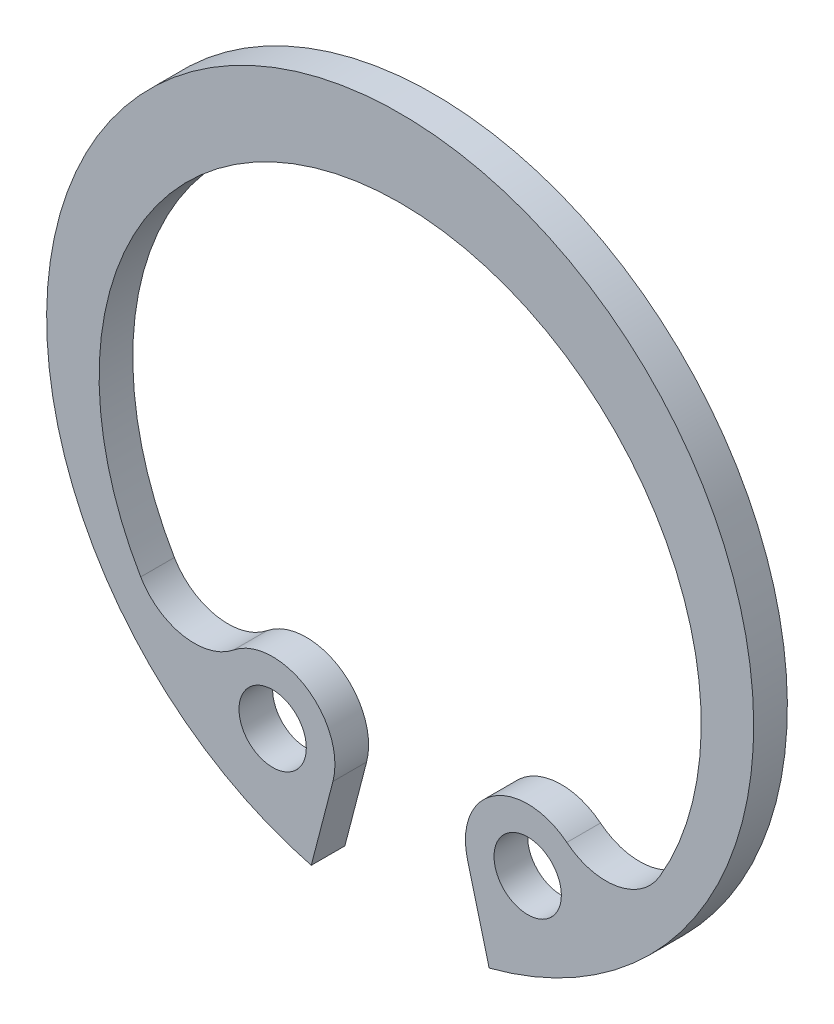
from build123d import *

# Parameters (mm, degrees)
BODYSKE_R  = 1
BODY_DEPTH = 1


with BuildPart() as part:
    # BodySke → Body (new body)
    with BuildSketch(Plane.XY):
        with BuildLine():
            Line((2.641661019, -10.162264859), (1.99690803, -7.681950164))
            ThreePointArc((1.99690803, -7.681950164), (2.784516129, -5.661934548), (4.949584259, -5.777128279))
            ThreePointArc((4.949584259, -5.777128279), (6.442678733, -6.157905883), (7.706206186, -5.275964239))
            ThreePointArc((7.706206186, -5.275964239), (0, 8.2), (-7.706206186, -5.275964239))
            ThreePointArc((-7.706206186, -5.275964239), (-6.442678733, -6.157905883), (-4.949584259, -5.777128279))
            ThreePointArc((-4.949584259, -5.777128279), (-2.784516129, -5.661934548), (-1.99690803, -7.681950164))
            Line((-1.99690803, -7.681950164), (-2.641661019, -10.162264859))
            ThreePointArc((-2.641661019, -10.162264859), (0, 10.5), (2.641661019, -10.162264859))
        make_face()
        with Locations((3.787402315, -7.216514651)):
            Circle(BODYSKE_R, mode=Mode.SUBTRACT)
        with Locations((-3.787402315, -7.216514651)):
            Circle(BODYSKE_R, mode=Mode.SUBTRACT)
    extrude(amount=-BODY_DEPTH)


solid = part.part
